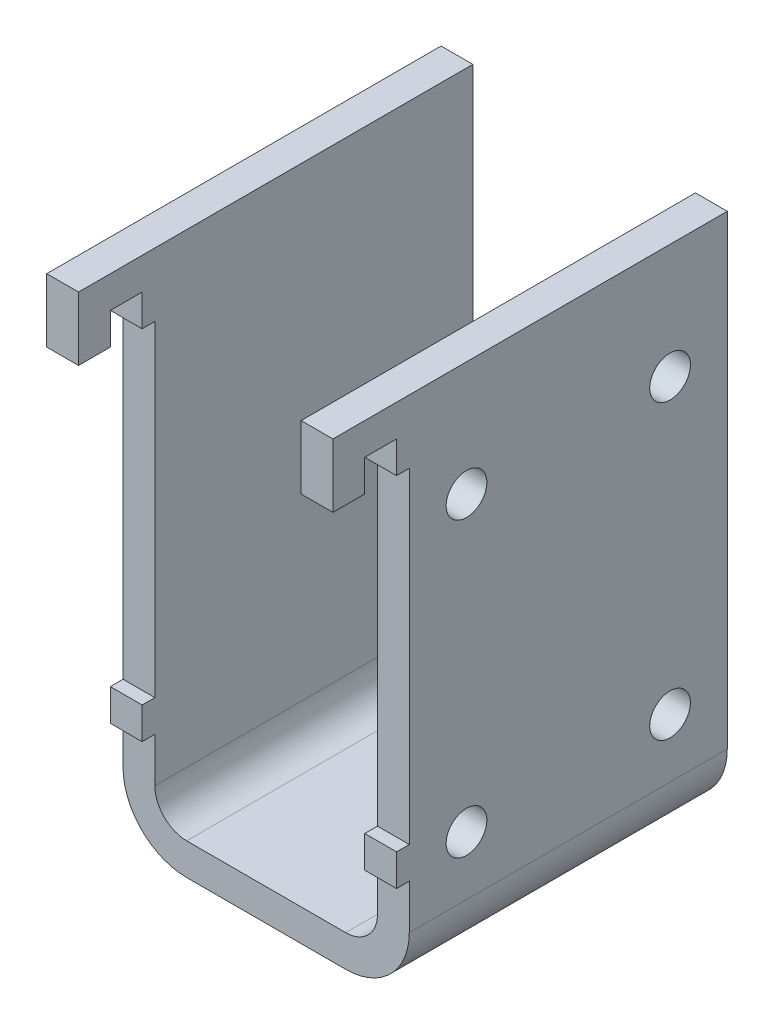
ISO-10303-21;
HEADER;
FILE_DESCRIPTION(('STEP AP214'),'2;1');
FILE_NAME('part.step','',(''),(''),'','','');
FILE_SCHEMA(('AUTOMOTIVE_DESIGN { 1 0 10303 214 1 1 1 1 }'));
ENDSEC;
DATA;
#1=APPLICATION_CONTEXT('core data for automotive mechanical design processes');
#2=APPLICATION_PROTOCOL_DEFINITION('international standard','automotive_design',2000,#1);
#3=PRODUCT_CONTEXT('',#1,'mechanical');
#4=PRODUCT('Part','Part','',(#3));
#5=PRODUCT_RELATED_PRODUCT_CATEGORY('part','',(#4));
#6=PRODUCT_DEFINITION_FORMATION('','',#4);
#7=PRODUCT_DEFINITION_CONTEXT('part definition',#1,'design');
#8=PRODUCT_DEFINITION('design','',#6,#7);
#9=PRODUCT_DEFINITION_SHAPE('','',#8);
#10=(LENGTH_UNIT() NAMED_UNIT(*) SI_UNIT(.MILLI.,.METRE.));
#11=(NAMED_UNIT(*) PLANE_ANGLE_UNIT() SI_UNIT($,.RADIAN.));
#12=(NAMED_UNIT(*) SI_UNIT($,.STERADIAN.) SOLID_ANGLE_UNIT());
#13=UNCERTAINTY_MEASURE_WITH_UNIT(LENGTH_MEASURE(1.E-05),#10,'distance_accuracy_value','');
#14=(GEOMETRIC_REPRESENTATION_CONTEXT(3) GLOBAL_UNCERTAINTY_ASSIGNED_CONTEXT((#13)) GLOBAL_UNIT_ASSIGNED_CONTEXT((#10,
#11,#12)) REPRESENTATION_CONTEXT('',''));
#15=CARTESIAN_POINT('',(0.,0.,0.));
#16=DIRECTION('',(0.,0.,1.));
#17=DIRECTION('',(1.,0.,0.));
#18=AXIS2_PLACEMENT_3D('',#15,#16,#17);
#19=CARTESIAN_POINT('',(30.,-5.,62.));
#20=DIRECTION('',(0.,0.,1.));
#21=DIRECTION('',(1.,0.,0.));
#22=AXIS2_PLACEMENT_3D('',#19,#20,#21);
#23=PLANE('',#22);
#24=DIRECTION('',(0.,1.,0.));
#25=VECTOR('',#24,1.);
#26=CARTESIAN_POINT('',(35.,0.,62.));
#27=LINE('',#26,#25);
#28=CARTESIAN_POINT('',(35.,68.22,62.));
#29=VERTEX_POINT('',#28);
#30=CARTESIAN_POINT('',(35.,78.22,62.));
#31=VERTEX_POINT('',#30);
#32=EDGE_CURVE('E406',#29,#31,#27,.T.);
#33=ORIENTED_EDGE('',*,*,#32,.F.);
#34=DIRECTION('',(1.,0.,0.));
#35=VECTOR('',#34,1.);
#36=CARTESIAN_POINT('',(-158.89134741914,68.22,62.));
#37=LINE('',#36,#35);
#38=CARTESIAN_POINT('',(40.,68.22,62.));
#39=VERTEX_POINT('',#38);
#40=EDGE_CURVE('E261',#29,#39,#37,.T.);
#41=ORIENTED_EDGE('',*,*,#40,.T.);
#42=DIRECTION('',(0.,1.,0.));
#43=VECTOR('',#42,1.);
#44=CARTESIAN_POINT('',(40.,0.,62.));
#45=LINE('',#44,#43);
#46=CARTESIAN_POINT('',(40.,78.22,62.));
#47=VERTEX_POINT('',#46);
#48=EDGE_CURVE('E400',#39,#47,#45,.T.);
#49=ORIENTED_EDGE('',*,*,#48,.T.);
#50=DIRECTION('',(1.,0.,0.));
#51=VECTOR('',#50,1.);
#52=CARTESIAN_POINT('',(35.,78.22,62.));
#53=LINE('',#52,#51);
#54=EDGE_CURVE('E402',#31,#47,#53,.T.);
#55=ORIENTED_EDGE('',*,*,#54,.F.);
#56=EDGE_LOOP('',(#33,#41,#49,#55));
#57=FACE_BOUND('',#56,.T.);
#58=ADVANCED_FACE('F34',(#57),#23,.T.);
#59=CARTESIAN_POINT('',(40.,0.,62.));
#60=DIRECTION('',(-1.,0.,0.));
#61=DIRECTION('',(0.,-1.,0.));
#62=AXIS2_PLACEMENT_3D('',#59,#60,#61);
#63=PLANE('',#62);
#64=CARTESIAN_POINT('',(40.,60.22,9.00000000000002));
#65=DIRECTION('',(1.,0.,0.));
#66=DIRECTION('',(0.,1.,0.));
#67=AXIS2_PLACEMENT_3D('',#64,#65,#66);
#68=CIRCLE('',#67,3.2);
#69=CARTESIAN_POINT('',(40.,63.42,9.00000000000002));
#70=VERTEX_POINT('',#69);
#71=EDGE_CURVE('E1063',#70,#70,#68,.T.);
#72=ORIENTED_EDGE('',*,*,#71,.F.);
#73=EDGE_LOOP('',(#72));
#74=FACE_BOUND('',#73,.T.);
#75=CARTESIAN_POINT('',(40.,14.22,9.00000000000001));
#76=DIRECTION('',(1.,0.,0.));
#77=DIRECTION('',(0.,1.,0.));
#78=AXIS2_PLACEMENT_3D('',#75,#76,#77);
#79=CIRCLE('',#78,3.2);
#80=CARTESIAN_POINT('',(40.,17.42,9.00000000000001));
#81=VERTEX_POINT('',#80);
#82=EDGE_CURVE('E1065',#81,#81,#79,.T.);
#83=ORIENTED_EDGE('',*,*,#82,.F.);
#84=EDGE_LOOP('',(#83));
#85=FACE_BOUND('',#84,.T.);
#86=CARTESIAN_POINT('',(40.,60.22,41.));
#87=DIRECTION('',(1.,0.,0.));
#88=DIRECTION('',(0.,1.,0.));
#89=AXIS2_PLACEMENT_3D('',#86,#87,#88);
#90=CIRCLE('',#89,3.2);
#91=CARTESIAN_POINT('',(40.,63.42,41.));
#92=VERTEX_POINT('',#91);
#93=EDGE_CURVE('E1071',#92,#92,#90,.T.);
#94=ORIENTED_EDGE('',*,*,#93,.F.);
#95=EDGE_LOOP('',(#94));
#96=FACE_BOUND('',#95,.T.);
#97=CARTESIAN_POINT('',(40.,14.22,41.));
#98=DIRECTION('',(1.,0.,0.));
#99=DIRECTION('',(0.,1.,0.));
#100=AXIS2_PLACEMENT_3D('',#97,#98,#99);
#101=CIRCLE('',#100,3.2);
#102=CARTESIAN_POINT('',(40.,17.42,41.));
#103=VERTEX_POINT('',#102);
#104=EDGE_CURVE('E1077',#103,#103,#101,.T.);
#105=ORIENTED_EDGE('',*,*,#104,.F.);
#106=EDGE_LOOP('',(#105));
#107=FACE_BOUND('',#106,.T.);
#108=DIRECTION('',(0.,0.,1.));
#109=VECTOR('',#108,1.);
#110=CARTESIAN_POINT('',(40.,68.22,62.));
#111=LINE('',#110,#109);
#112=CARTESIAN_POINT('',(40.,68.22,57.));
#113=VERTEX_POINT('',#112);
#114=EDGE_CURVE('E49',#113,#39,#111,.T.);
#115=ORIENTED_EDGE('',*,*,#114,.F.);
#116=DIRECTION('',(0.,-1.,0.));
#117=VECTOR('',#116,1.);
#118=CARTESIAN_POINT('',(40.,0.,57.));
#119=LINE('',#118,#117);
#120=CARTESIAN_POINT('',(40.,73.22,57.));
#121=VERTEX_POINT('',#120);
#122=EDGE_CURVE('E53',#121,#113,#119,.T.);
#123=ORIENTED_EDGE('',*,*,#122,.F.);
#124=DIRECTION('',(0.,0.,1.));
#125=VECTOR('',#124,1.);
#126=CARTESIAN_POINT('',(40.,73.22,62.0000000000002));
#127=LINE('',#126,#125);
#128=CARTESIAN_POINT('',(40.,73.22,52.));
#129=VERTEX_POINT('',#128);
#130=EDGE_CURVE('E392',#129,#121,#127,.T.);
#131=ORIENTED_EDGE('',*,*,#130,.F.);
#132=DIRECTION('',(0.,1.,0.));
#133=VECTOR('',#132,1.);
#134=CARTESIAN_POINT('',(40.,0.,52.));
#135=LINE('',#134,#133);
#136=CARTESIAN_POINT('',(40.,68.22,52.));
#137=VERTEX_POINT('',#136);
#138=EDGE_CURVE('E385',#137,#129,#135,.T.);
#139=ORIENTED_EDGE('',*,*,#138,.F.);
#140=DIRECTION('',(0.,0.,1.));
#141=VECTOR('',#140,1.);
#142=CARTESIAN_POINT('',(40.,68.2199999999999,62.0000000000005));
#143=LINE('',#142,#141);
#144=CARTESIAN_POINT('',(40.,68.22,50.));
#145=VERTEX_POINT('',#144);
#146=EDGE_CURVE('E379',#145,#137,#143,.T.);
#147=ORIENTED_EDGE('',*,*,#146,.F.);
#148=DIRECTION('',(0.,1.,0.));
#149=VECTOR('',#148,1.);
#150=CARTESIAN_POINT('',(40.,0.,50.));
#151=LINE('',#150,#149);
#152=CARTESIAN_POINT('',(40.,17.,50.));
#153=VERTEX_POINT('',#152);
#154=EDGE_CURVE('E372',#153,#145,#151,.T.);
#155=ORIENTED_EDGE('',*,*,#154,.F.);
#156=DIRECTION('',(0.,0.,-1.));
#157=VECTOR('',#156,1.);
#158=CARTESIAN_POINT('',(40.,17.,62.));
#159=LINE('',#158,#157);
#160=CARTESIAN_POINT('',(40.,17.,52.));
#161=VERTEX_POINT('',#160);
#162=EDGE_CURVE('E365',#161,#153,#159,.T.);
#163=ORIENTED_EDGE('',*,*,#162,.F.);
#164=DIRECTION('',(0.,1.,0.));
#165=VECTOR('',#164,1.);
#166=CARTESIAN_POINT('',(40.,0.,52.));
#167=LINE('',#166,#165);
#168=CARTESIAN_POINT('',(40.,12.,52.));
#169=VERTEX_POINT('',#168);
#170=EDGE_CURVE('E358',#169,#161,#167,.T.);
#171=ORIENTED_EDGE('',*,*,#170,.F.);
#172=DIRECTION('',(0.,0.,1.));
#173=VECTOR('',#172,1.);
#174=CARTESIAN_POINT('',(40.,12.,62.));
#175=LINE('',#174,#173);
#176=CARTESIAN_POINT('',(40.,12.,50.));
#177=VERTEX_POINT('',#176);
#178=EDGE_CURVE('E351',#177,#169,#175,.T.);
#179=ORIENTED_EDGE('',*,*,#178,.F.);
#180=DIRECTION('',(0.,1.,0.));
#181=VECTOR('',#180,1.);
#182=CARTESIAN_POINT('',(40.,0.,50.));
#183=LINE('',#182,#181);
#184=CARTESIAN_POINT('',(40.,5.,50.));
#185=VERTEX_POINT('',#184);
#186=EDGE_CURVE('E328',#185,#177,#183,.T.);
#187=ORIENTED_EDGE('',*,*,#186,.F.);
#188=DIRECTION('',(0.,0.,-1.));
#189=VECTOR('',#188,1.);
#190=CARTESIAN_POINT('',(40.,5.,62.));
#191=LINE('',#190,#189);
#192=CARTESIAN_POINT('',(40.,5.,0.));
#193=VERTEX_POINT('',#192);
#194=EDGE_CURVE('E252',#185,#193,#191,.T.);
#195=ORIENTED_EDGE('',*,*,#194,.T.);
#196=DIRECTION('',(0.,1.,0.));
#197=VECTOR('',#196,1.);
#198=CARTESIAN_POINT('',(40.,0.,0.));
#199=LINE('',#198,#197);
#200=CARTESIAN_POINT('',(40.,78.22,0.));
#201=VERTEX_POINT('',#200);
#202=EDGE_CURVE('E399',#193,#201,#199,.T.);
#203=ORIENTED_EDGE('',*,*,#202,.T.);
#204=DIRECTION('',(0.,0.,-1.));
#205=VECTOR('',#204,1.);
#206=CARTESIAN_POINT('',(40.,78.22,62.));
#207=LINE('',#206,#205);
#208=EDGE_CURVE('E466',#47,#201,#207,.T.);
#209=ORIENTED_EDGE('',*,*,#208,.F.);
#210=ORIENTED_EDGE('',*,*,#48,.F.);
#211=EDGE_LOOP('',(#115,#123,#131,#139,#147,#155,#163,#171,#179,#187,#195,#203,#209,#210));
#212=FACE_BOUND('',#211,.T.);
#213=ADVANCED_FACE('F585',(#74,#85,#96,#107,#212),#63,.F.);
#214=CARTESIAN_POINT('',(35.,0.,62.));
#215=DIRECTION('',(-1.,0.,0.));
#216=DIRECTION('',(0.,-1.,0.));
#217=AXIS2_PLACEMENT_3D('',#214,#215,#216);
#218=PLANE('',#217);
#219=CARTESIAN_POINT('',(35.,60.22,9.00000000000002));
#220=DIRECTION('',(1.,0.,0.));
#221=DIRECTION('',(0.,1.,0.));
#222=AXIS2_PLACEMENT_3D('',#219,#220,#221);
#223=CIRCLE('',#222,3.2);
#224=CARTESIAN_POINT('',(35.,63.42,9.00000000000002));
#225=VERTEX_POINT('',#224);
#226=EDGE_CURVE('E1060',#225,#225,#223,.T.);
#227=ORIENTED_EDGE('',*,*,#226,.T.);
#228=EDGE_LOOP('',(#227));
#229=FACE_BOUND('',#228,.T.);
#230=CARTESIAN_POINT('',(35.,14.22,9.00000000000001));
#231=DIRECTION('',(1.,0.,0.));
#232=DIRECTION('',(0.,1.,0.));
#233=AXIS2_PLACEMENT_3D('',#230,#231,#232);
#234=CIRCLE('',#233,3.2);
#235=CARTESIAN_POINT('',(35.,17.42,9.00000000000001));
#236=VERTEX_POINT('',#235);
#237=EDGE_CURVE('E1068',#236,#236,#234,.T.);
#238=ORIENTED_EDGE('',*,*,#237,.T.);
#239=EDGE_LOOP('',(#238));
#240=FACE_BOUND('',#239,.T.);
#241=CARTESIAN_POINT('',(35.,60.22,41.));
#242=DIRECTION('',(1.,0.,0.));
#243=DIRECTION('',(0.,1.,0.));
#244=AXIS2_PLACEMENT_3D('',#241,#242,#243);
#245=CIRCLE('',#244,3.2);
#246=CARTESIAN_POINT('',(35.,63.42,41.));
#247=VERTEX_POINT('',#246);
#248=EDGE_CURVE('E1074',#247,#247,#245,.T.);
#249=ORIENTED_EDGE('',*,*,#248,.T.);
#250=EDGE_LOOP('',(#249));
#251=FACE_BOUND('',#250,.T.);
#252=CARTESIAN_POINT('',(35.,14.22,41.));
#253=DIRECTION('',(1.,0.,0.));
#254=DIRECTION('',(0.,1.,0.));
#255=AXIS2_PLACEMENT_3D('',#252,#253,#254);
#256=CIRCLE('',#255,3.2);
#257=CARTESIAN_POINT('',(35.,17.42,41.));
#258=VERTEX_POINT('',#257);
#259=EDGE_CURVE('E1080',#258,#258,#256,.T.);
#260=ORIENTED_EDGE('',*,*,#259,.T.);
#261=EDGE_LOOP('',(#260));
#262=FACE_BOUND('',#261,.T.);
#263=DIRECTION('',(0.,-1.,0.));
#264=VECTOR('',#263,1.);
#265=CARTESIAN_POINT('',(35.,0.,57.));
#266=LINE('',#265,#264);
#267=CARTESIAN_POINT('',(35.,73.22,57.));
#268=VERTEX_POINT('',#267);
#269=CARTESIAN_POINT('',(35.,68.22,57.));
#270=VERTEX_POINT('',#269);
#271=EDGE_CURVE('E396',#268,#270,#266,.T.);
#272=ORIENTED_EDGE('',*,*,#271,.T.);
#273=DIRECTION('',(0.,0.,1.));
#274=VECTOR('',#273,1.);
#275=CARTESIAN_POINT('',(35.,68.22,62.));
#276=LINE('',#275,#274);
#277=EDGE_CURVE('E325',#270,#29,#276,.T.);
#278=ORIENTED_EDGE('',*,*,#277,.T.);
#279=ORIENTED_EDGE('',*,*,#32,.T.);
#280=DIRECTION('',(0.,0.,-1.));
#281=VECTOR('',#280,1.);
#282=CARTESIAN_POINT('',(35.,78.22,62.));
#283=LINE('',#282,#281);
#284=CARTESIAN_POINT('',(35.,78.22,0.));
#285=VERTEX_POINT('',#284);
#286=EDGE_CURVE('E464',#31,#285,#283,.T.);
#287=ORIENTED_EDGE('',*,*,#286,.T.);
#288=DIRECTION('',(0.,1.,0.));
#289=VECTOR('',#288,1.);
#290=CARTESIAN_POINT('',(35.,0.,0.));
#291=LINE('',#290,#289);
#292=CARTESIAN_POINT('',(35.,5.,0.));
#293=VERTEX_POINT('',#292);
#294=EDGE_CURVE('E416',#293,#285,#291,.T.);
#295=ORIENTED_EDGE('',*,*,#294,.F.);
#296=DIRECTION('',(0.,0.,-1.));
#297=VECTOR('',#296,1.);
#298=CARTESIAN_POINT('',(35.,5.,62.));
#299=LINE('',#298,#297);
#300=CARTESIAN_POINT('',(35.,5.,50.));
#301=VERTEX_POINT('',#300);
#302=EDGE_CURVE('E462',#301,#293,#299,.T.);
#303=ORIENTED_EDGE('',*,*,#302,.F.);
#304=DIRECTION('',(0.,1.,0.));
#305=VECTOR('',#304,1.);
#306=CARTESIAN_POINT('',(35.,0.,50.));
#307=LINE('',#306,#305);
#308=CARTESIAN_POINT('',(35.,12.,50.));
#309=VERTEX_POINT('',#308);
#310=EDGE_CURVE('E345',#301,#309,#307,.T.);
#311=ORIENTED_EDGE('',*,*,#310,.T.);
#312=DIRECTION('',(0.,0.,1.));
#313=VECTOR('',#312,1.);
#314=CARTESIAN_POINT('',(35.,12.,62.));
#315=LINE('',#314,#313);
#316=CARTESIAN_POINT('',(35.,12.,52.));
#317=VERTEX_POINT('',#316);
#318=EDGE_CURVE('E349',#309,#317,#315,.T.);
#319=ORIENTED_EDGE('',*,*,#318,.T.);
#320=DIRECTION('',(0.,1.,0.));
#321=VECTOR('',#320,1.);
#322=CARTESIAN_POINT('',(35.,0.,52.));
#323=LINE('',#322,#321);
#324=CARTESIAN_POINT('',(35.,17.,52.));
#325=VERTEX_POINT('',#324);
#326=EDGE_CURVE('E356',#317,#325,#323,.T.);
#327=ORIENTED_EDGE('',*,*,#326,.T.);
#328=DIRECTION('',(0.,0.,-1.));
#329=VECTOR('',#328,1.);
#330=CARTESIAN_POINT('',(35.,17.,62.));
#331=LINE('',#330,#329);
#332=CARTESIAN_POINT('',(35.,17.,50.));
#333=VERTEX_POINT('',#332);
#334=EDGE_CURVE('E363',#325,#333,#331,.T.);
#335=ORIENTED_EDGE('',*,*,#334,.T.);
#336=DIRECTION('',(0.,1.,0.));
#337=VECTOR('',#336,1.);
#338=CARTESIAN_POINT('',(35.,0.,50.));
#339=LINE('',#338,#337);
#340=CARTESIAN_POINT('',(35.,68.22,50.));
#341=VERTEX_POINT('',#340);
#342=EDGE_CURVE('E370',#333,#341,#339,.T.);
#343=ORIENTED_EDGE('',*,*,#342,.T.);
#344=DIRECTION('',(0.,0.,1.));
#345=VECTOR('',#344,1.);
#346=CARTESIAN_POINT('',(35.,68.2199999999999,62.0000000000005));
#347=LINE('',#346,#345);
#348=CARTESIAN_POINT('',(35.,68.22,52.));
#349=VERTEX_POINT('',#348);
#350=EDGE_CURVE('E377',#341,#349,#347,.T.);
#351=ORIENTED_EDGE('',*,*,#350,.T.);
#352=DIRECTION('',(0.,1.,0.));
#353=VECTOR('',#352,1.);
#354=CARTESIAN_POINT('',(35.,0.,52.));
#355=LINE('',#354,#353);
#356=CARTESIAN_POINT('',(35.,73.22,52.));
#357=VERTEX_POINT('',#356);
#358=EDGE_CURVE('E383',#349,#357,#355,.T.);
#359=ORIENTED_EDGE('',*,*,#358,.T.);
#360=DIRECTION('',(0.,0.,1.));
#361=VECTOR('',#360,1.);
#362=CARTESIAN_POINT('',(35.,73.22,62.0000000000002));
#363=LINE('',#362,#361);
#364=EDGE_CURVE('E390',#357,#268,#363,.T.);
#365=ORIENTED_EDGE('',*,*,#364,.T.);
#366=EDGE_LOOP('',(#272,#278,#279,#287,#295,#303,#311,#319,#327,#335,#343,#351,#359,#365));
#367=FACE_BOUND('',#366,.T.);
#368=ADVANCED_FACE('F577',(#229,#240,#251,#262,#367),#218,.T.);
#369=CARTESIAN_POINT('',(30.,5.,62.));
#370=DIRECTION('',(0.,0.,-1.));
#371=DIRECTION('',(-1.,0.,0.));
#372=AXIS2_PLACEMENT_3D('',#369,#370,#371);
#373=CYLINDRICAL_SURFACE('',#372,5.);
#374=DIRECTION('',(0.,0.,-1.));
#375=VECTOR('',#374,1.);
#376=CARTESIAN_POINT('',(30.,0.,62.));
#377=LINE('',#376,#375);
#378=CARTESIAN_POINT('',(30.,0.,50.));
#379=VERTEX_POINT('',#378);
#380=CARTESIAN_POINT('',(30.,0.,0.));
#381=VERTEX_POINT('',#380);
#382=EDGE_CURVE('E460',#379,#381,#377,.T.);
#383=ORIENTED_EDGE('',*,*,#382,.F.);
#384=CARTESIAN_POINT('',(30.,5.,50.));
#385=DIRECTION('',(0.,0.,1.));
#386=DIRECTION('',(0.,-1.,0.));
#387=AXIS2_PLACEMENT_3D('',#384,#385,#386);
#388=CIRCLE('',#387,5.);
#389=EDGE_CURVE('E343',#379,#301,#388,.T.);
#390=ORIENTED_EDGE('',*,*,#389,.T.);
#391=ORIENTED_EDGE('',*,*,#302,.T.);
#392=CARTESIAN_POINT('',(30.,5.,0.));
#393=DIRECTION('',(0.,0.,-1.));
#394=DIRECTION('',(-1.,0.,0.));
#395=AXIS2_PLACEMENT_3D('',#392,#393,#394);
#396=CIRCLE('',#395,5.);
#397=EDGE_CURVE('E419',#381,#293,#396,.F.);
#398=ORIENTED_EDGE('',*,*,#397,.F.);
#399=EDGE_LOOP('',(#383,#390,#391,#398));
#400=FACE_BOUND('',#399,.T.);
#401=ADVANCED_FACE('F570',(#400),#373,.F.);
#402=CARTESIAN_POINT('',(0.,0.,62.));
#403=DIRECTION('',(0.,1.,0.));
#404=DIRECTION('',(0.,0.,1.));
#405=AXIS2_PLACEMENT_3D('',#402,#403,#404);
#406=PLANE('',#405);
#407=CARTESIAN_POINT('',(17.5,0.,25.));
#408=DIRECTION('',(0.,-1.,0.));
#409=DIRECTION('',(0.,0.,-1.));
#410=AXIS2_PLACEMENT_3D('',#407,#408,#409);
#411=CIRCLE('',#410,3.9);
#412=CARTESIAN_POINT('',(17.5,0.,21.1));
#413=VERTEX_POINT('',#412);
#414=EDGE_CURVE('E519',#413,#413,#411,.T.);
#415=ORIENTED_EDGE('',*,*,#414,.T.);
#416=EDGE_LOOP('',(#415));
#417=FACE_BOUND('',#416,.T.);
#418=DIRECTION('',(0.,0.,-1.));
#419=VECTOR('',#418,1.);
#420=CARTESIAN_POINT('',(5.,0.,62.));
#421=LINE('',#420,#419);
#422=CARTESIAN_POINT('',(5.,0.,50.));
#423=VERTEX_POINT('',#422);
#424=CARTESIAN_POINT('',(5.,0.,0.));
#425=VERTEX_POINT('',#424);
#426=EDGE_CURVE('E458',#423,#425,#421,.T.);
#427=ORIENTED_EDGE('',*,*,#426,.F.);
#428=DIRECTION('',(1.,0.,0.));
#429=VECTOR('',#428,1.);
#430=CARTESIAN_POINT('',(0.,0.,50.));
#431=LINE('',#430,#429);
#432=EDGE_CURVE('E341',#423,#379,#431,.T.);
#433=ORIENTED_EDGE('',*,*,#432,.T.);
#434=ORIENTED_EDGE('',*,*,#382,.T.);
#435=DIRECTION('',(1.,0.,0.));
#436=VECTOR('',#435,1.);
#437=CARTESIAN_POINT('',(0.,0.,0.));
#438=LINE('',#437,#436);
#439=EDGE_CURVE('E422',#425,#381,#438,.T.);
#440=ORIENTED_EDGE('',*,*,#439,.F.);
#441=EDGE_LOOP('',(#427,#433,#434,#440));
#442=FACE_BOUND('',#441,.T.);
#443=ADVANCED_FACE('F483',(#417,#442),#406,.T.);
#444=CARTESIAN_POINT('',(5.,5.,62.));
#445=DIRECTION('',(0.,0.,-1.));
#446=DIRECTION('',(-1.,0.,0.));
#447=AXIS2_PLACEMENT_3D('',#444,#445,#446);
#448=CYLINDRICAL_SURFACE('',#447,5.);
#449=DIRECTION('',(0.,0.,-1.));
#450=VECTOR('',#449,1.);
#451=CARTESIAN_POINT('',(0.,5.,62.));
#452=LINE('',#451,#450);
#453=CARTESIAN_POINT('',(0.,5.,50.));
#454=VERTEX_POINT('',#453);
#455=CARTESIAN_POINT('',(0.,5.,0.));
#456=VERTEX_POINT('',#455);
#457=EDGE_CURVE('E456',#454,#456,#452,.T.);
#458=ORIENTED_EDGE('',*,*,#457,.F.);
#459=CARTESIAN_POINT('',(5.,5.,50.));
#460=DIRECTION('',(0.,0.,1.));
#461=DIRECTION('',(0.,-1.,0.));
#462=AXIS2_PLACEMENT_3D('',#459,#460,#461);
#463=CIRCLE('',#462,5.);
#464=EDGE_CURVE('E339',#454,#423,#463,.T.);
#465=ORIENTED_EDGE('',*,*,#464,.T.);
#466=ORIENTED_EDGE('',*,*,#426,.T.);
#467=CARTESIAN_POINT('',(5.,5.,0.));
#468=DIRECTION('',(0.,0.,-1.));
#469=DIRECTION('',(-1.,0.,0.));
#470=AXIS2_PLACEMENT_3D('',#467,#468,#469);
#471=CIRCLE('',#470,5.);
#472=EDGE_CURVE('E425',#456,#425,#471,.F.);
#473=ORIENTED_EDGE('',*,*,#472,.F.);
#474=EDGE_LOOP('',(#458,#465,#466,#473));
#475=FACE_BOUND('',#474,.T.);
#476=ADVANCED_FACE('F491',(#475),#448,.F.);
#477=CARTESIAN_POINT('',(0.,0.,62.));
#478=DIRECTION('',(1.,0.,0.));
#479=DIRECTION('',(0.,0.,-1.));
#480=AXIS2_PLACEMENT_3D('',#477,#478,#479);
#481=PLANE('',#480);
#482=DIRECTION('',(0.,-1.,0.));
#483=VECTOR('',#482,1.);
#484=CARTESIAN_POINT('',(0.,0.,62.));
#485=LINE('',#484,#483);
#486=CARTESIAN_POINT('',(0.,78.22,62.));
#487=VERTEX_POINT('',#486);
#488=CARTESIAN_POINT('',(0.,68.22,62.));
#489=VERTEX_POINT('',#488);
#490=EDGE_CURVE('E408',#487,#489,#485,.T.);
#491=ORIENTED_EDGE('',*,*,#490,.T.);
#492=DIRECTION('',(0.,0.,-1.));
#493=VECTOR('',#492,1.);
#494=CARTESIAN_POINT('',(0.,68.22,62.));
#495=LINE('',#494,#493);
#496=CARTESIAN_POINT('',(0.,68.22,57.));
#497=VERTEX_POINT('',#496);
#498=EDGE_CURVE('E260',#489,#497,#495,.T.);
#499=ORIENTED_EDGE('',*,*,#498,.T.);
#500=DIRECTION('',(0.,1.,0.));
#501=VECTOR('',#500,1.);
#502=CARTESIAN_POINT('',(0.,0.,57.));
#503=LINE('',#502,#501);
#504=CARTESIAN_POINT('',(0.,73.22,57.));
#505=VERTEX_POINT('',#504);
#506=EDGE_CURVE('E394',#497,#505,#503,.T.);
#507=ORIENTED_EDGE('',*,*,#506,.T.);
#508=DIRECTION('',(0.,0.,-1.));
#509=VECTOR('',#508,1.);
#510=CARTESIAN_POINT('',(0.,73.22,62.0000000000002));
#511=LINE('',#510,#509);
#512=CARTESIAN_POINT('',(0.,73.22,52.));
#513=VERTEX_POINT('',#512);
#514=EDGE_CURVE('E388',#505,#513,#511,.T.);
#515=ORIENTED_EDGE('',*,*,#514,.T.);
#516=DIRECTION('',(0.,-1.,0.));
#517=VECTOR('',#516,1.);
#518=CARTESIAN_POINT('',(0.,0.,52.));
#519=LINE('',#518,#517);
#520=CARTESIAN_POINT('',(0.,68.22,52.));
#521=VERTEX_POINT('',#520);
#522=EDGE_CURVE('E307',#513,#521,#519,.T.);
#523=ORIENTED_EDGE('',*,*,#522,.T.);
#524=DIRECTION('',(0.,0.,-1.));
#525=VECTOR('',#524,1.);
#526=CARTESIAN_POINT('',(0.,68.2199999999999,62.0000000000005));
#527=LINE('',#526,#525);
#528=CARTESIAN_POINT('',(0.,68.22,50.));
#529=VERTEX_POINT('',#528);
#530=EDGE_CURVE('E375',#521,#529,#527,.T.);
#531=ORIENTED_EDGE('',*,*,#530,.T.);
#532=DIRECTION('',(0.,-1.,0.));
#533=VECTOR('',#532,1.);
#534=CARTESIAN_POINT('',(0.,0.,50.));
#535=LINE('',#534,#533);
#536=CARTESIAN_POINT('',(0.,17.,50.));
#537=VERTEX_POINT('',#536);
#538=EDGE_CURVE('E368',#529,#537,#535,.T.);
#539=ORIENTED_EDGE('',*,*,#538,.T.);
#540=DIRECTION('',(0.,0.,1.));
#541=VECTOR('',#540,1.);
#542=CARTESIAN_POINT('',(0.,17.,62.));
#543=LINE('',#542,#541);
#544=CARTESIAN_POINT('',(0.,17.,52.));
#545=VERTEX_POINT('',#544);
#546=EDGE_CURVE('E361',#537,#545,#543,.T.);
#547=ORIENTED_EDGE('',*,*,#546,.T.);
#548=DIRECTION('',(0.,-1.,0.));
#549=VECTOR('',#548,1.);
#550=CARTESIAN_POINT('',(0.,0.,52.));
#551=LINE('',#550,#549);
#552=CARTESIAN_POINT('',(0.,12.,52.));
#553=VERTEX_POINT('',#552);
#554=EDGE_CURVE('E354',#545,#553,#551,.T.);
#555=ORIENTED_EDGE('',*,*,#554,.T.);
#556=DIRECTION('',(0.,0.,-1.));
#557=VECTOR('',#556,1.);
#558=CARTESIAN_POINT('',(0.,12.,62.));
#559=LINE('',#558,#557);
#560=CARTESIAN_POINT('',(0.,12.,50.));
#561=VERTEX_POINT('',#560);
#562=EDGE_CURVE('E347',#553,#561,#559,.T.);
#563=ORIENTED_EDGE('',*,*,#562,.T.);
#564=DIRECTION('',(0.,-1.,0.));
#565=VECTOR('',#564,1.);
#566=CARTESIAN_POINT('',(0.,0.,50.));
#567=LINE('',#566,#565);
#568=EDGE_CURVE('E337',#561,#454,#567,.T.);
#569=ORIENTED_EDGE('',*,*,#568,.T.);
#570=ORIENTED_EDGE('',*,*,#457,.T.);
#571=DIRECTION('',(0.,-1.,0.));
#572=VECTOR('',#571,1.);
#573=CARTESIAN_POINT('',(0.,0.,0.));
#574=LINE('',#573,#572);
#575=CARTESIAN_POINT('',(0.,78.22,0.));
#576=VERTEX_POINT('',#575);
#577=EDGE_CURVE('E428',#576,#456,#574,.T.);
#578=ORIENTED_EDGE('',*,*,#577,.F.);
#579=DIRECTION('',(0.,0.,-1.));
#580=VECTOR('',#579,1.);
#581=CARTESIAN_POINT('',(0.,78.22,62.));
#582=LINE('',#581,#580);
#583=EDGE_CURVE('E454',#487,#576,#582,.T.);
#584=ORIENTED_EDGE('',*,*,#583,.F.);
#585=EDGE_LOOP('',(#491,#499,#507,#515,#523,#531,#539,#547,#555,#563,#569,#570,#578,#584));
#586=FACE_BOUND('',#585,.T.);
#587=ADVANCED_FACE('F499',(#586),#481,.T.);
#588=CARTESIAN_POINT('',(-5.,0.,62.));
#589=DIRECTION('',(1.,0.,0.));
#590=DIRECTION('',(0.,0.,-1.));
#591=AXIS2_PLACEMENT_3D('',#588,#589,#590);
#592=PLANE('',#591);
#593=DIRECTION('',(0.,0.,-1.));
#594=VECTOR('',#593,1.);
#595=CARTESIAN_POINT('',(-5.,68.22,62.));
#596=LINE('',#595,#594);
#597=CARTESIAN_POINT('',(-5.,68.22,62.));
#598=VERTEX_POINT('',#597);
#599=CARTESIAN_POINT('',(-5.,68.22,57.));
#600=VERTEX_POINT('',#599);
#601=EDGE_CURVE('E255',#598,#600,#596,.T.);
#602=ORIENTED_EDGE('',*,*,#601,.F.);
#603=DIRECTION('',(0.,1.,0.));
#604=VECTOR('',#603,1.);
#605=CARTESIAN_POINT('',(-5.,0.,62.));
#606=LINE('',#605,#604);
#607=CARTESIAN_POINT('',(-5.,78.22,62.));
#608=VERTEX_POINT('',#607);
#609=EDGE_CURVE('E242',#608,#598,#606,.F.);
#610=ORIENTED_EDGE('',*,*,#609,.F.);
#611=DIRECTION('',(0.,0.,-1.));
#612=VECTOR('',#611,1.);
#613=CARTESIAN_POINT('',(-5.,78.22,62.));
#614=LINE('',#613,#612);
#615=CARTESIAN_POINT('',(-5.,78.22,0.));
#616=VERTEX_POINT('',#615);
#617=EDGE_CURVE('E452',#608,#616,#614,.T.);
#618=ORIENTED_EDGE('',*,*,#617,.T.);
#619=DIRECTION('',(0.,1.,0.));
#620=VECTOR('',#619,1.);
#621=CARTESIAN_POINT('',(-5.,0.,0.));
#622=LINE('',#621,#620);
#623=CARTESIAN_POINT('',(-5.,5.,0.));
#624=VERTEX_POINT('',#623);
#625=EDGE_CURVE('E434',#616,#624,#622,.F.);
#626=ORIENTED_EDGE('',*,*,#625,.T.);
#627=DIRECTION('',(0.,0.,-1.));
#628=VECTOR('',#627,1.);
#629=CARTESIAN_POINT('',(-5.,5.,62.));
#630=LINE('',#629,#628);
#631=CARTESIAN_POINT('',(-5.,5.,50.));
#632=VERTEX_POINT('',#631);
#633=EDGE_CURVE('E450',#632,#624,#630,.T.);
#634=ORIENTED_EDGE('',*,*,#633,.F.);
#635=DIRECTION('',(0.,-1.,0.));
#636=VECTOR('',#635,1.);
#637=CARTESIAN_POINT('',(-5.,0.,50.));
#638=LINE('',#637,#636);
#639=CARTESIAN_POINT('',(-5.,12.,50.));
#640=VERTEX_POINT('',#639);
#641=EDGE_CURVE('E334',#640,#632,#638,.T.);
#642=ORIENTED_EDGE('',*,*,#641,.F.);
#643=DIRECTION('',(0.,0.,-1.));
#644=VECTOR('',#643,1.);
#645=CARTESIAN_POINT('',(-5.,12.,62.));
#646=LINE('',#645,#644);
#647=CARTESIAN_POINT('',(-5.,12.,52.));
#648=VERTEX_POINT('',#647);
#649=EDGE_CURVE('E269',#648,#640,#646,.T.);
#650=ORIENTED_EDGE('',*,*,#649,.F.);
#651=DIRECTION('',(0.,-1.,0.));
#652=VECTOR('',#651,1.);
#653=CARTESIAN_POINT('',(-5.,0.,52.));
#654=LINE('',#653,#652);
#655=CARTESIAN_POINT('',(-5.,17.,52.));
#656=VERTEX_POINT('',#655);
#657=EDGE_CURVE('E278',#656,#648,#654,.T.);
#658=ORIENTED_EDGE('',*,*,#657,.F.);
#659=DIRECTION('',(0.,0.,1.));
#660=VECTOR('',#659,1.);
#661=CARTESIAN_POINT('',(-5.,17.,62.));
#662=LINE('',#661,#660);
#663=CARTESIAN_POINT('',(-5.,17.,50.));
#664=VERTEX_POINT('',#663);
#665=EDGE_CURVE('E281',#664,#656,#662,.T.);
#666=ORIENTED_EDGE('',*,*,#665,.F.);
#667=DIRECTION('',(0.,-1.,0.));
#668=VECTOR('',#667,1.);
#669=CARTESIAN_POINT('',(-5.,0.,50.));
#670=LINE('',#669,#668);
#671=CARTESIAN_POINT('',(-5.,68.22,50.));
#672=VERTEX_POINT('',#671);
#673=EDGE_CURVE('E284',#672,#664,#670,.T.);
#674=ORIENTED_EDGE('',*,*,#673,.F.);
#675=DIRECTION('',(0.,0.,-1.));
#676=VECTOR('',#675,1.);
#677=CARTESIAN_POINT('',(-5.,68.2199999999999,62.0000000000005));
#678=LINE('',#677,#676);
#679=CARTESIAN_POINT('',(-5.,68.22,52.));
#680=VERTEX_POINT('',#679);
#681=EDGE_CURVE('E287',#680,#672,#678,.T.);
#682=ORIENTED_EDGE('',*,*,#681,.F.);
#683=DIRECTION('',(0.,-1.,0.));
#684=VECTOR('',#683,1.);
#685=CARTESIAN_POINT('',(-5.,0.,52.));
#686=LINE('',#685,#684);
#687=CARTESIAN_POINT('',(-5.,73.22,52.));
#688=VERTEX_POINT('',#687);
#689=EDGE_CURVE('E290',#688,#680,#686,.T.);
#690=ORIENTED_EDGE('',*,*,#689,.F.);
#691=DIRECTION('',(0.,0.,-1.));
#692=VECTOR('',#691,1.);
#693=CARTESIAN_POINT('',(-5.,73.22,62.0000000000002));
#694=LINE('',#693,#692);
#695=CARTESIAN_POINT('',(-5.,73.22,57.));
#696=VERTEX_POINT('',#695);
#697=EDGE_CURVE('E42',#696,#688,#694,.T.);
#698=ORIENTED_EDGE('',*,*,#697,.F.);
#699=DIRECTION('',(0.,1.,0.));
#700=VECTOR('',#699,1.);
#701=CARTESIAN_POINT('',(-5.,0.,57.));
#702=LINE('',#701,#700);
#703=EDGE_CURVE('E11',#600,#696,#702,.T.);
#704=ORIENTED_EDGE('',*,*,#703,.F.);
#705=EDGE_LOOP('',(#602,#610,#618,#626,#634,#642,#650,#658,#666,#674,#682,#690,#698,#704));
#706=FACE_BOUND('',#705,.T.);
#707=ADVANCED_FACE('F256',(#706),#592,.F.);
#708=CARTESIAN_POINT('',(5.,5.,62.));
#709=DIRECTION('',(0.,0.,-1.));
#710=DIRECTION('',(-1.,0.,0.));
#711=AXIS2_PLACEMENT_3D('',#708,#709,#710);
#712=CYLINDRICAL_SURFACE('',#711,10.);
#713=CARTESIAN_POINT('',(5.,5.,50.));
#714=DIRECTION('',(0.,0.,1.));
#715=DIRECTION('',(0.,-1.,0.));
#716=AXIS2_PLACEMENT_3D('',#713,#714,#715);
#717=CIRCLE('',#716,10.);
#718=CARTESIAN_POINT('',(5.,-5.,50.));
#719=VERTEX_POINT('',#718);
#720=EDGE_CURVE('E331',#632,#719,#717,.T.);
#721=ORIENTED_EDGE('',*,*,#720,.F.);
#722=ORIENTED_EDGE('',*,*,#633,.T.);
#723=CARTESIAN_POINT('',(5.,5.,0.));
#724=DIRECTION('',(0.,0.,1.));
#725=DIRECTION('',(1.,0.,0.));
#726=AXIS2_PLACEMENT_3D('',#723,#724,#725);
#727=CIRCLE('',#726,10.);
#728=CARTESIAN_POINT('',(5.,-5.,0.));
#729=VERTEX_POINT('',#728);
#730=EDGE_CURVE('E437',#624,#729,#727,.T.);
#731=ORIENTED_EDGE('',*,*,#730,.T.);
#732=DIRECTION('',(0.,0.,-1.));
#733=VECTOR('',#732,1.);
#734=CARTESIAN_POINT('',(5.,-5.,62.));
#735=LINE('',#734,#733);
#736=EDGE_CURVE('E448',#719,#729,#735,.T.);
#737=ORIENTED_EDGE('',*,*,#736,.F.);
#738=EDGE_LOOP('',(#721,#722,#731,#737));
#739=FACE_BOUND('',#738,.T.);
#740=ADVANCED_FACE('F556',(#739),#712,.T.);
#741=CARTESIAN_POINT('',(0.,-5.,62.));
#742=DIRECTION('',(0.,1.,0.));
#743=DIRECTION('',(0.,0.,1.));
#744=AXIS2_PLACEMENT_3D('',#741,#742,#743);
#745=PLANE('',#744);
#746=CARTESIAN_POINT('',(17.5,-5.,25.));
#747=DIRECTION('',(0.,-1.,0.));
#748=DIRECTION('',(0.,0.,-1.));
#749=AXIS2_PLACEMENT_3D('',#746,#747,#748);
#750=CIRCLE('',#749,3.9);
#751=CARTESIAN_POINT('',(17.5,-5.,21.1));
#752=VERTEX_POINT('',#751);
#753=EDGE_CURVE('E1083',#752,#752,#750,.T.);
#754=ORIENTED_EDGE('',*,*,#753,.F.);
#755=EDGE_LOOP('',(#754));
#756=FACE_BOUND('',#755,.T.);
#757=DIRECTION('',(1.,0.,0.));
#758=VECTOR('',#757,1.);
#759=CARTESIAN_POINT('',(-158.89134741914,-5.,50.));
#760=LINE('',#759,#758);
#761=CARTESIAN_POINT('',(30.,-5.,50.));
#762=VERTEX_POINT('',#761);
#763=EDGE_CURVE('E512',#719,#762,#760,.T.);
#764=ORIENTED_EDGE('',*,*,#763,.F.);
#765=ORIENTED_EDGE('',*,*,#736,.T.);
#766=DIRECTION('',(1.,0.,0.));
#767=VECTOR('',#766,1.);
#768=CARTESIAN_POINT('',(0.,-5.,0.));
#769=LINE('',#768,#767);
#770=CARTESIAN_POINT('',(30.,-5.,0.));
#771=VERTEX_POINT('',#770);
#772=EDGE_CURVE('E440',#729,#771,#769,.T.);
#773=ORIENTED_EDGE('',*,*,#772,.T.);
#774=DIRECTION('',(0.,0.,-1.));
#775=VECTOR('',#774,1.);
#776=CARTESIAN_POINT('',(30.,-5.,62.));
#777=LINE('',#776,#775);
#778=EDGE_CURVE('E446',#762,#771,#777,.T.);
#779=ORIENTED_EDGE('',*,*,#778,.F.);
#780=EDGE_LOOP('',(#764,#765,#773,#779));
#781=FACE_BOUND('',#780,.T.);
#782=ADVANCED_FACE('F558',(#756,#781),#745,.F.);
#783=CARTESIAN_POINT('',(30.,5.,62.));
#784=DIRECTION('',(0.,0.,-1.));
#785=DIRECTION('',(-1.,0.,0.));
#786=AXIS2_PLACEMENT_3D('',#783,#784,#785);
#787=CYLINDRICAL_SURFACE('',#786,10.);
#788=CARTESIAN_POINT('',(30.,5.,50.));
#789=DIRECTION('',(0.,0.,1.));
#790=DIRECTION('',(0.,-1.,0.));
#791=AXIS2_PLACEMENT_3D('',#788,#789,#790);
#792=CIRCLE('',#791,10.);
#793=EDGE_CURVE('E265',#762,#185,#792,.T.);
#794=ORIENTED_EDGE('',*,*,#793,.F.);
#795=ORIENTED_EDGE('',*,*,#778,.T.);
#796=CARTESIAN_POINT('',(30.,5.,0.));
#797=DIRECTION('',(0.,0.,1.));
#798=DIRECTION('',(1.,0.,0.));
#799=AXIS2_PLACEMENT_3D('',#796,#797,#798);
#800=CIRCLE('',#799,10.);
#801=EDGE_CURVE('E403',#771,#193,#800,.T.);
#802=ORIENTED_EDGE('',*,*,#801,.T.);
#803=ORIENTED_EDGE('',*,*,#194,.F.);
#804=EDGE_LOOP('',(#794,#795,#802,#803));
#805=FACE_BOUND('',#804,.T.);
#806=ADVANCED_FACE('F562',(#805),#787,.T.);
#807=CARTESIAN_POINT('',(30.,5.,62.));
#808=DIRECTION('',(0.,0.,-1.));
#809=DIRECTION('',(-1.,0.,0.));
#810=AXIS2_PLACEMENT_3D('',#807,#808,#809);
#811=PLANE('',#810);
#812=DIRECTION('',(-1.,0.,0.));
#813=VECTOR('',#812,1.);
#814=CARTESIAN_POINT('',(30.,68.22,62.));
#815=LINE('',#814,#813);
#816=EDGE_CURVE('E247',#489,#598,#815,.T.);
#817=ORIENTED_EDGE('',*,*,#816,.F.);
#818=ORIENTED_EDGE('',*,*,#490,.F.);
#819=DIRECTION('',(1.,0.,0.));
#820=VECTOR('',#819,1.);
#821=CARTESIAN_POINT('',(-5.,78.22,62.));
#822=LINE('',#821,#820);
#823=EDGE_CURVE('E250',#608,#487,#822,.T.);
#824=ORIENTED_EDGE('',*,*,#823,.F.);
#825=ORIENTED_EDGE('',*,*,#609,.T.);
#826=EDGE_LOOP('',(#817,#818,#824,#825));
#827=FACE_BOUND('',#826,.T.);
#828=ADVANCED_FACE('F244',(#827),#811,.F.);
#829=CARTESIAN_POINT('',(0.,5.,0.));
#830=DIRECTION('',(0.,0.,-1.));
#831=DIRECTION('',(-1.,0.,0.));
#832=AXIS2_PLACEMENT_3D('',#829,#830,#831);
#833=PLANE('',#832);
#834=DIRECTION('',(-1.,0.,0.));
#835=VECTOR('',#834,1.);
#836=CARTESIAN_POINT('',(0.,5.,0.));
#837=LINE('',#836,#835);
#838=EDGE_CURVE('E266',#456,#624,#837,.T.);
#839=ORIENTED_EDGE('',*,*,#838,.F.);
#840=ORIENTED_EDGE('',*,*,#472,.T.);
#841=DIRECTION('',(0.,1.,0.));
#842=VECTOR('',#841,1.);
#843=CARTESIAN_POINT('',(5.,-5.,0.));
#844=LINE('',#843,#842);
#845=EDGE_CURVE('E272',#729,#425,#844,.T.);
#846=ORIENTED_EDGE('',*,*,#845,.F.);
#847=ORIENTED_EDGE('',*,*,#730,.F.);
#848=EDGE_LOOP('',(#839,#840,#846,#847));
#849=FACE_BOUND('',#848,.T.);
#850=ADVANCED_FACE('F36',(#849),#833,.T.);
#851=CARTESIAN_POINT('',(5.,-5.,0.));
#852=DIRECTION('',(0.,0.,-1.));
#853=DIRECTION('',(-1.,0.,0.));
#854=AXIS2_PLACEMENT_3D('',#851,#852,#853);
#855=PLANE('',#854);
#856=ORIENTED_EDGE('',*,*,#577,.T.);
#857=ORIENTED_EDGE('',*,*,#838,.T.);
#858=ORIENTED_EDGE('',*,*,#625,.F.);
#859=DIRECTION('',(1.,0.,0.));
#860=VECTOR('',#859,1.);
#861=CARTESIAN_POINT('',(-5.,78.22,0.));
#862=LINE('',#861,#860);
#863=EDGE_CURVE('E431',#616,#576,#862,.T.);
#864=ORIENTED_EDGE('',*,*,#863,.T.);
#865=EDGE_LOOP('',(#856,#857,#858,#864));
#866=FACE_BOUND('',#865,.T.);
#867=ADVANCED_FACE('F495',(#866),#855,.T.);
#868=CARTESIAN_POINT('',(30.,0.,0.));
#869=DIRECTION('',(0.,0.,-1.));
#870=DIRECTION('',(-1.,0.,0.));
#871=AXIS2_PLACEMENT_3D('',#868,#869,#870);
#872=PLANE('',#871);
#873=DIRECTION('',(0.,-1.,0.));
#874=VECTOR('',#873,1.);
#875=CARTESIAN_POINT('',(30.,0.,0.));
#876=LINE('',#875,#874);
#877=EDGE_CURVE('E471',#381,#771,#876,.T.);
#878=ORIENTED_EDGE('',*,*,#877,.F.);
#879=ORIENTED_EDGE('',*,*,#397,.T.);
#880=DIRECTION('',(-1.,0.,0.));
#881=VECTOR('',#880,1.);
#882=CARTESIAN_POINT('',(40.,5.,0.));
#883=LINE('',#882,#881);
#884=EDGE_CURVE('E468',#193,#293,#883,.T.);
#885=ORIENTED_EDGE('',*,*,#884,.F.);
#886=ORIENTED_EDGE('',*,*,#801,.F.);
#887=EDGE_LOOP('',(#878,#879,#885,#886));
#888=FACE_BOUND('',#887,.T.);
#889=ADVANCED_FACE('F567',(#888),#872,.T.);
#890=CARTESIAN_POINT('',(40.,5.,0.));
#891=DIRECTION('',(0.,0.,-1.));
#892=DIRECTION('',(-1.,0.,0.));
#893=AXIS2_PLACEMENT_3D('',#890,#891,#892);
#894=PLANE('',#893);
#895=ORIENTED_EDGE('',*,*,#439,.T.);
#896=ORIENTED_EDGE('',*,*,#877,.T.);
#897=ORIENTED_EDGE('',*,*,#772,.F.);
#898=ORIENTED_EDGE('',*,*,#845,.T.);
#899=EDGE_LOOP('',(#895,#896,#897,#898));
#900=FACE_BOUND('',#899,.T.);
#901=ADVANCED_FACE('F478',(#900),#894,.T.);
#902=CARTESIAN_POINT('',(35.,78.22,62.));
#903=DIRECTION('',(0.,1.,0.));
#904=DIRECTION('',(0.,0.,1.));
#905=AXIS2_PLACEMENT_3D('',#902,#903,#904);
#906=PLANE('',#905);
#907=DIRECTION('',(1.,0.,0.));
#908=VECTOR('',#907,1.);
#909=CARTESIAN_POINT('',(35.,78.22,0.));
#910=LINE('',#909,#908);
#911=EDGE_CURVE('E413',#285,#201,#910,.T.);
#912=ORIENTED_EDGE('',*,*,#911,.F.);
#913=ORIENTED_EDGE('',*,*,#286,.F.);
#914=ORIENTED_EDGE('',*,*,#54,.T.);
#915=ORIENTED_EDGE('',*,*,#208,.T.);
#916=EDGE_LOOP('',(#912,#913,#914,#915));
#917=FACE_BOUND('',#916,.T.);
#918=ADVANCED_FACE('F583',(#917),#906,.T.);
#919=CARTESIAN_POINT('',(-5.,78.22,62.));
#920=DIRECTION('',(0.,1.,0.));
#921=DIRECTION('',(0.,0.,1.));
#922=AXIS2_PLACEMENT_3D('',#919,#920,#921);
#923=PLANE('',#922);
#924=ORIENTED_EDGE('',*,*,#863,.F.);
#925=ORIENTED_EDGE('',*,*,#617,.F.);
#926=ORIENTED_EDGE('',*,*,#823,.T.);
#927=ORIENTED_EDGE('',*,*,#583,.T.);
#928=EDGE_LOOP('',(#924,#925,#926,#927));
#929=FACE_BOUND('',#928,.T.);
#930=ADVANCED_FACE('F653',(#929),#923,.T.);
#931=CARTESIAN_POINT('',(30.,5.,0.));
#932=DIRECTION('',(0.,0.,-1.));
#933=DIRECTION('',(-1.,0.,0.));
#934=AXIS2_PLACEMENT_3D('',#931,#932,#933);
#935=PLANE('',#934);
#936=ORIENTED_EDGE('',*,*,#202,.F.);
#937=ORIENTED_EDGE('',*,*,#884,.T.);
#938=ORIENTED_EDGE('',*,*,#294,.T.);
#939=ORIENTED_EDGE('',*,*,#911,.T.);
#940=EDGE_LOOP('',(#936,#937,#938,#939));
#941=FACE_BOUND('',#940,.T.);
#942=ADVANCED_FACE('F576',(#941),#935,.T.);
#943=CARTESIAN_POINT('',(-158.89134741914,68.22,57.));
#944=DIRECTION('',(0.,0.,-1.));
#945=DIRECTION('',(-1.,0.,0.));
#946=AXIS2_PLACEMENT_3D('',#943,#944,#945);
#947=PLANE('',#946);
#948=DIRECTION('',(1.,0.,0.));
#949=VECTOR('',#948,1.);
#950=CARTESIAN_POINT('',(-158.89134741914,73.22,57.));
#951=LINE('',#950,#949);
#952=EDGE_CURVE('E308',#268,#121,#951,.T.);
#953=ORIENTED_EDGE('',*,*,#952,.T.);
#954=ORIENTED_EDGE('',*,*,#122,.T.);
#955=DIRECTION('',(1.,0.,0.));
#956=VECTOR('',#955,1.);
#957=CARTESIAN_POINT('',(-158.89134741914,68.22,57.));
#958=LINE('',#957,#956);
#959=EDGE_CURVE('E319',#270,#113,#958,.T.);
#960=ORIENTED_EDGE('',*,*,#959,.F.);
#961=ORIENTED_EDGE('',*,*,#271,.F.);
#962=EDGE_LOOP('',(#953,#954,#960,#961));
#963=FACE_BOUND('',#962,.T.);
#964=ADVANCED_FACE('F617',(#963),#947,.T.);
#965=ORIENTED_EDGE('',*,*,#506,.F.);
#966=EDGE_CURVE('E322',#600,#497,#958,.T.);
#967=ORIENTED_EDGE('',*,*,#966,.F.);
#968=ORIENTED_EDGE('',*,*,#703,.T.);
#969=EDGE_CURVE('E301',#696,#505,#951,.T.);
#970=ORIENTED_EDGE('',*,*,#969,.T.);
#971=EDGE_LOOP('',(#965,#967,#968,#970));
#972=FACE_BOUND('',#971,.T.);
#973=ADVANCED_FACE('F614',(#972),#947,.T.);
#974=CARTESIAN_POINT('',(-158.89134741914,73.22,57.));
#975=DIRECTION('',(0.,-1.,0.));
#976=DIRECTION('',(0.,0.,-1.));
#977=AXIS2_PLACEMENT_3D('',#974,#975,#976);
#978=PLANE('',#977);
#979=DIRECTION('',(1.,0.,0.));
#980=VECTOR('',#979,1.);
#981=CARTESIAN_POINT('',(-158.89134741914,73.22,52.));
#982=LINE('',#981,#980);
#983=EDGE_CURVE('E309',#357,#129,#982,.T.);
#984=ORIENTED_EDGE('',*,*,#983,.T.);
#985=ORIENTED_EDGE('',*,*,#130,.T.);
#986=ORIENTED_EDGE('',*,*,#952,.F.);
#987=ORIENTED_EDGE('',*,*,#364,.F.);
#988=EDGE_LOOP('',(#984,#985,#986,#987));
#989=FACE_BOUND('',#988,.T.);
#990=ADVANCED_FACE('F616',(#989),#978,.T.);
#991=ORIENTED_EDGE('',*,*,#514,.F.);
#992=ORIENTED_EDGE('',*,*,#969,.F.);
#993=ORIENTED_EDGE('',*,*,#697,.T.);
#994=EDGE_CURVE('E299',#688,#513,#982,.T.);
#995=ORIENTED_EDGE('',*,*,#994,.T.);
#996=EDGE_LOOP('',(#991,#992,#993,#995));
#997=FACE_BOUND('',#996,.T.);
#998=ADVANCED_FACE('F298',(#997),#978,.T.);
#999=CARTESIAN_POINT('',(-158.89134741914,73.22,52.));
#1000=DIRECTION('',(0.,0.,1.));
#1001=DIRECTION('',(1.,0.,0.));
#1002=AXIS2_PLACEMENT_3D('',#999,#1000,#1001);
#1003=PLANE('',#1002);
#1004=DIRECTION('',(1.,0.,0.));
#1005=VECTOR('',#1004,1.);
#1006=CARTESIAN_POINT('',(-158.89134741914,68.22,52.));
#1007=LINE('',#1006,#1005);
#1008=EDGE_CURVE('E316',#349,#137,#1007,.T.);
#1009=ORIENTED_EDGE('',*,*,#1008,.T.);
#1010=ORIENTED_EDGE('',*,*,#138,.T.);
#1011=ORIENTED_EDGE('',*,*,#983,.F.);
#1012=ORIENTED_EDGE('',*,*,#358,.F.);
#1013=EDGE_LOOP('',(#1009,#1010,#1011,#1012));
#1014=FACE_BOUND('',#1013,.T.);
#1015=ADVANCED_FACE('F607',(#1014),#1003,.T.);
#1016=ORIENTED_EDGE('',*,*,#522,.F.);
#1017=ORIENTED_EDGE('',*,*,#994,.F.);
#1018=ORIENTED_EDGE('',*,*,#689,.T.);
#1019=EDGE_CURVE('E314',#680,#521,#1007,.T.);
#1020=ORIENTED_EDGE('',*,*,#1019,.T.);
#1021=EDGE_LOOP('',(#1016,#1017,#1018,#1020));
#1022=FACE_BOUND('',#1021,.T.);
#1023=ADVANCED_FACE('F304',(#1022),#1003,.T.);
#1024=CARTESIAN_POINT('',(-158.89134741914,68.22,52.));
#1025=DIRECTION('',(0.,-1.,0.));
#1026=DIRECTION('',(0.,0.,-1.));
#1027=AXIS2_PLACEMENT_3D('',#1024,#1025,#1026);
#1028=PLANE('',#1027);
#1029=DIRECTION('',(1.,0.,0.));
#1030=VECTOR('',#1029,1.);
#1031=CARTESIAN_POINT('',(-158.89134741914,68.22,50.));
#1032=LINE('',#1031,#1030);
#1033=EDGE_CURVE('E532',#341,#145,#1032,.T.);
#1034=ORIENTED_EDGE('',*,*,#1033,.T.);
#1035=ORIENTED_EDGE('',*,*,#146,.T.);
#1036=ORIENTED_EDGE('',*,*,#1008,.F.);
#1037=ORIENTED_EDGE('',*,*,#350,.F.);
#1038=EDGE_LOOP('',(#1034,#1035,#1036,#1037));
#1039=FACE_BOUND('',#1038,.T.);
#1040=ADVANCED_FACE('F604',(#1039),#1028,.T.);
#1041=ORIENTED_EDGE('',*,*,#530,.F.);
#1042=ORIENTED_EDGE('',*,*,#1019,.F.);
#1043=ORIENTED_EDGE('',*,*,#681,.T.);
#1044=EDGE_CURVE('E534',#672,#529,#1032,.T.);
#1045=ORIENTED_EDGE('',*,*,#1044,.T.);
#1046=EDGE_LOOP('',(#1041,#1042,#1043,#1045));
#1047=FACE_BOUND('',#1046,.T.);
#1048=ADVANCED_FACE('F611',(#1047),#1028,.T.);
#1049=CARTESIAN_POINT('',(-158.89134741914,68.22,50.));
#1050=DIRECTION('',(0.,0.,1.));
#1051=DIRECTION('',(0.,-1.,0.));
#1052=AXIS2_PLACEMENT_3D('',#1049,#1050,#1051);
#1053=PLANE('',#1052);
#1054=DIRECTION('',(1.,0.,0.));
#1055=VECTOR('',#1054,1.);
#1056=CARTESIAN_POINT('',(-158.89134741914,17.,50.));
#1057=LINE('',#1056,#1055);
#1058=EDGE_CURVE('E529',#333,#153,#1057,.T.);
#1059=ORIENTED_EDGE('',*,*,#1058,.T.);
#1060=ORIENTED_EDGE('',*,*,#154,.T.);
#1061=ORIENTED_EDGE('',*,*,#1033,.F.);
#1062=ORIENTED_EDGE('',*,*,#342,.F.);
#1063=EDGE_LOOP('',(#1059,#1060,#1061,#1062));
#1064=FACE_BOUND('',#1063,.T.);
#1065=ADVANCED_FACE('F601',(#1064),#1053,.T.);
#1066=ORIENTED_EDGE('',*,*,#538,.F.);
#1067=ORIENTED_EDGE('',*,*,#1044,.F.);
#1068=ORIENTED_EDGE('',*,*,#673,.T.);
#1069=EDGE_CURVE('E531',#664,#537,#1057,.T.);
#1070=ORIENTED_EDGE('',*,*,#1069,.T.);
#1071=EDGE_LOOP('',(#1066,#1067,#1068,#1070));
#1072=FACE_BOUND('',#1071,.T.);
#1073=ADVANCED_FACE('F543',(#1072),#1053,.T.);
#1074=CARTESIAN_POINT('',(-158.89134741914,17.,50.));
#1075=DIRECTION('',(0.,1.,0.));
#1076=DIRECTION('',(0.,0.,1.));
#1077=AXIS2_PLACEMENT_3D('',#1074,#1075,#1076);
#1078=PLANE('',#1077);
#1079=DIRECTION('',(1.,0.,0.));
#1080=VECTOR('',#1079,1.);
#1081=CARTESIAN_POINT('',(-158.89134741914,17.,52.));
#1082=LINE('',#1081,#1080);
#1083=EDGE_CURVE('E525',#325,#161,#1082,.T.);
#1084=ORIENTED_EDGE('',*,*,#1083,.T.);
#1085=ORIENTED_EDGE('',*,*,#162,.T.);
#1086=ORIENTED_EDGE('',*,*,#1058,.F.);
#1087=ORIENTED_EDGE('',*,*,#334,.F.);
#1088=EDGE_LOOP('',(#1084,#1085,#1086,#1087));
#1089=FACE_BOUND('',#1088,.T.);
#1090=ADVANCED_FACE('F597',(#1089),#1078,.T.);
#1091=ORIENTED_EDGE('',*,*,#546,.F.);
#1092=ORIENTED_EDGE('',*,*,#1069,.F.);
#1093=ORIENTED_EDGE('',*,*,#665,.T.);
#1094=EDGE_CURVE('E528',#656,#545,#1082,.T.);
#1095=ORIENTED_EDGE('',*,*,#1094,.T.);
#1096=EDGE_LOOP('',(#1091,#1092,#1093,#1095));
#1097=FACE_BOUND('',#1096,.T.);
#1098=ADVANCED_FACE('F547',(#1097),#1078,.T.);
#1099=CARTESIAN_POINT('',(-158.89134741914,17.,52.));
#1100=DIRECTION('',(0.,0.,1.));
#1101=DIRECTION('',(1.,0.,0.));
#1102=AXIS2_PLACEMENT_3D('',#1099,#1100,#1101);
#1103=PLANE('',#1102);
#1104=DIRECTION('',(1.,0.,0.));
#1105=VECTOR('',#1104,1.);
#1106=CARTESIAN_POINT('',(-158.89134741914,12.,52.));
#1107=LINE('',#1106,#1105);
#1108=EDGE_CURVE('E516',#317,#169,#1107,.T.);
#1109=ORIENTED_EDGE('',*,*,#1108,.T.);
#1110=ORIENTED_EDGE('',*,*,#170,.T.);
#1111=ORIENTED_EDGE('',*,*,#1083,.F.);
#1112=ORIENTED_EDGE('',*,*,#326,.F.);
#1113=EDGE_LOOP('',(#1109,#1110,#1111,#1112));
#1114=FACE_BOUND('',#1113,.T.);
#1115=ADVANCED_FACE('F595',(#1114),#1103,.T.);
#1116=ORIENTED_EDGE('',*,*,#554,.F.);
#1117=ORIENTED_EDGE('',*,*,#1094,.F.);
#1118=ORIENTED_EDGE('',*,*,#657,.T.);
#1119=EDGE_CURVE('E524',#648,#553,#1107,.T.);
#1120=ORIENTED_EDGE('',*,*,#1119,.T.);
#1121=EDGE_LOOP('',(#1116,#1117,#1118,#1120));
#1122=FACE_BOUND('',#1121,.T.);
#1123=ADVANCED_FACE('F552',(#1122),#1103,.T.);
#1124=CARTESIAN_POINT('',(-158.89134741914,12.,52.));
#1125=DIRECTION('',(0.,-1.,0.));
#1126=DIRECTION('',(0.,0.,-1.));
#1127=AXIS2_PLACEMENT_3D('',#1124,#1125,#1126);
#1128=PLANE('',#1127);
#1129=DIRECTION('',(1.,0.,0.));
#1130=VECTOR('',#1129,1.);
#1131=CARTESIAN_POINT('',(-158.89134741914,12.,50.));
#1132=LINE('',#1131,#1130);
#1133=EDGE_CURVE('E513',#309,#177,#1132,.T.);
#1134=ORIENTED_EDGE('',*,*,#1133,.T.);
#1135=ORIENTED_EDGE('',*,*,#178,.T.);
#1136=ORIENTED_EDGE('',*,*,#1108,.F.);
#1137=ORIENTED_EDGE('',*,*,#318,.F.);
#1138=EDGE_LOOP('',(#1134,#1135,#1136,#1137));
#1139=FACE_BOUND('',#1138,.T.);
#1140=ADVANCED_FACE('F589',(#1139),#1128,.T.);
#1141=ORIENTED_EDGE('',*,*,#562,.F.);
#1142=ORIENTED_EDGE('',*,*,#1119,.F.);
#1143=ORIENTED_EDGE('',*,*,#649,.T.);
#1144=EDGE_CURVE('E507',#640,#561,#1132,.T.);
#1145=ORIENTED_EDGE('',*,*,#1144,.T.);
#1146=EDGE_LOOP('',(#1141,#1142,#1143,#1145));
#1147=FACE_BOUND('',#1146,.T.);
#1148=ADVANCED_FACE('F509',(#1147),#1128,.T.);
#1149=CARTESIAN_POINT('',(-158.89134741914,12.,50.));
#1150=DIRECTION('',(0.,0.,1.));
#1151=DIRECTION('',(0.,-1.,0.));
#1152=AXIS2_PLACEMENT_3D('',#1149,#1150,#1151);
#1153=PLANE('',#1152);
#1154=ORIENTED_EDGE('',*,*,#310,.F.);
#1155=ORIENTED_EDGE('',*,*,#389,.F.);
#1156=ORIENTED_EDGE('',*,*,#432,.F.);
#1157=ORIENTED_EDGE('',*,*,#464,.F.);
#1158=ORIENTED_EDGE('',*,*,#568,.F.);
#1159=ORIENTED_EDGE('',*,*,#1144,.F.);
#1160=ORIENTED_EDGE('',*,*,#641,.T.);
#1161=ORIENTED_EDGE('',*,*,#720,.T.);
#1162=ORIENTED_EDGE('',*,*,#763,.T.);
#1163=ORIENTED_EDGE('',*,*,#793,.T.);
#1164=ORIENTED_EDGE('',*,*,#186,.T.);
#1165=ORIENTED_EDGE('',*,*,#1133,.F.);
#1166=EDGE_LOOP('',(#1154,#1155,#1156,#1157,#1158,#1159,#1160,#1161,#1162,#1163,#1164,#1165));
#1167=FACE_BOUND('',#1166,.T.);
#1168=ADVANCED_FACE('F506',(#1167),#1153,.T.);
#1169=CARTESIAN_POINT('',(-158.89134741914,68.22,62.));
#1170=DIRECTION('',(0.,-1.,0.));
#1171=DIRECTION('',(0.,0.,-1.));
#1172=AXIS2_PLACEMENT_3D('',#1169,#1170,#1171);
#1173=PLANE('',#1172);
#1174=ORIENTED_EDGE('',*,*,#959,.T.);
#1175=ORIENTED_EDGE('',*,*,#114,.T.);
#1176=ORIENTED_EDGE('',*,*,#40,.F.);
#1177=ORIENTED_EDGE('',*,*,#277,.F.);
#1178=EDGE_LOOP('',(#1174,#1175,#1176,#1177));
#1179=FACE_BOUND('',#1178,.T.);
#1180=ADVANCED_FACE('F651',(#1179),#1173,.T.);
#1181=ORIENTED_EDGE('',*,*,#498,.F.);
#1182=ORIENTED_EDGE('',*,*,#816,.T.);
#1183=ORIENTED_EDGE('',*,*,#601,.T.);
#1184=ORIENTED_EDGE('',*,*,#966,.T.);
#1185=EDGE_LOOP('',(#1181,#1182,#1183,#1184));
#1186=FACE_BOUND('',#1185,.T.);
#1187=ADVANCED_FACE('F264',(#1186),#1173,.T.);
#1188=CARTESIAN_POINT('',(17.5,0.,25.));
#1189=DIRECTION('',(0.,-1.,0.));
#1190=DIRECTION('',(0.,0.,-1.));
#1191=AXIS2_PLACEMENT_3D('',#1188,#1189,#1190);
#1192=CYLINDRICAL_SURFACE('',#1191,3.9);
#1193=ORIENTED_EDGE('',*,*,#414,.F.);
#1194=EDGE_LOOP('',(#1193));
#1195=FACE_BOUND('',#1194,.T.);
#1196=ORIENTED_EDGE('',*,*,#753,.T.);
#1197=EDGE_LOOP('',(#1196));
#1198=FACE_BOUND('',#1197,.T.);
#1199=ADVANCED_FACE('F853',(#1195,#1198),#1192,.F.);
#1200=CARTESIAN_POINT('',(35.,14.22,41.));
#1201=DIRECTION('',(1.,0.,0.));
#1202=DIRECTION('',(0.,1.,0.));
#1203=AXIS2_PLACEMENT_3D('',#1200,#1201,#1202);
#1204=CYLINDRICAL_SURFACE('',#1203,3.2);
#1205=ORIENTED_EDGE('',*,*,#259,.F.);
#1206=EDGE_LOOP('',(#1205));
#1207=FACE_BOUND('',#1206,.T.);
#1208=ORIENTED_EDGE('',*,*,#104,.T.);
#1209=EDGE_LOOP('',(#1208));
#1210=FACE_BOUND('',#1209,.T.);
#1211=ADVANCED_FACE('F878',(#1207,#1210),#1204,.F.);
#1212=CARTESIAN_POINT('',(35.,60.22,41.));
#1213=DIRECTION('',(1.,0.,0.));
#1214=DIRECTION('',(0.,1.,0.));
#1215=AXIS2_PLACEMENT_3D('',#1212,#1213,#1214);
#1216=CYLINDRICAL_SURFACE('',#1215,3.2);
#1217=ORIENTED_EDGE('',*,*,#248,.F.);
#1218=EDGE_LOOP('',(#1217));
#1219=FACE_BOUND('',#1218,.T.);
#1220=ORIENTED_EDGE('',*,*,#93,.T.);
#1221=EDGE_LOOP('',(#1220));
#1222=FACE_BOUND('',#1221,.T.);
#1223=ADVANCED_FACE('F902',(#1219,#1222),#1216,.F.);
#1224=CARTESIAN_POINT('',(35.,14.22,9.00000000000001));
#1225=DIRECTION('',(1.,0.,0.));
#1226=DIRECTION('',(0.,1.,0.));
#1227=AXIS2_PLACEMENT_3D('',#1224,#1225,#1226);
#1228=CYLINDRICAL_SURFACE('',#1227,3.2);
#1229=ORIENTED_EDGE('',*,*,#237,.F.);
#1230=EDGE_LOOP('',(#1229));
#1231=FACE_BOUND('',#1230,.T.);
#1232=ORIENTED_EDGE('',*,*,#82,.T.);
#1233=EDGE_LOOP('',(#1232));
#1234=FACE_BOUND('',#1233,.T.);
#1235=ADVANCED_FACE('F913',(#1231,#1234),#1228,.F.);
#1236=CARTESIAN_POINT('',(35.,60.22,9.00000000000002));
#1237=DIRECTION('',(1.,0.,0.));
#1238=DIRECTION('',(0.,1.,0.));
#1239=AXIS2_PLACEMENT_3D('',#1236,#1237,#1238);
#1240=CYLINDRICAL_SURFACE('',#1239,3.2);
#1241=ORIENTED_EDGE('',*,*,#226,.F.);
#1242=EDGE_LOOP('',(#1241));
#1243=FACE_BOUND('',#1242,.T.);
#1244=ORIENTED_EDGE('',*,*,#71,.T.);
#1245=EDGE_LOOP('',(#1244));
#1246=FACE_BOUND('',#1245,.T.);
#1247=ADVANCED_FACE('F924',(#1243,#1246),#1240,.F.);
#1248=CLOSED_SHELL('',(#58,#213,#368,#401,#443,#476,#587,#707,#740,#782,#806,#828,#850,#867,
#889,#901,#918,#930,#942,#964,#973,#990,#998,#1015,#1023,#1040,#1048,#1065,#1073,#1090,#1098,
#1115,#1123,#1140,#1148,#1168,#1180,#1187,#1199,#1211,#1223,#1235,#1247));
#1249=MANIFOLD_SOLID_BREP('B2',#1248);
#1250=ADVANCED_BREP_SHAPE_REPRESENTATION('',(#18,#1249),#14);
#1251=SHAPE_DEFINITION_REPRESENTATION(#9,#1250);
ENDSEC;
END-ISO-10303-21;
